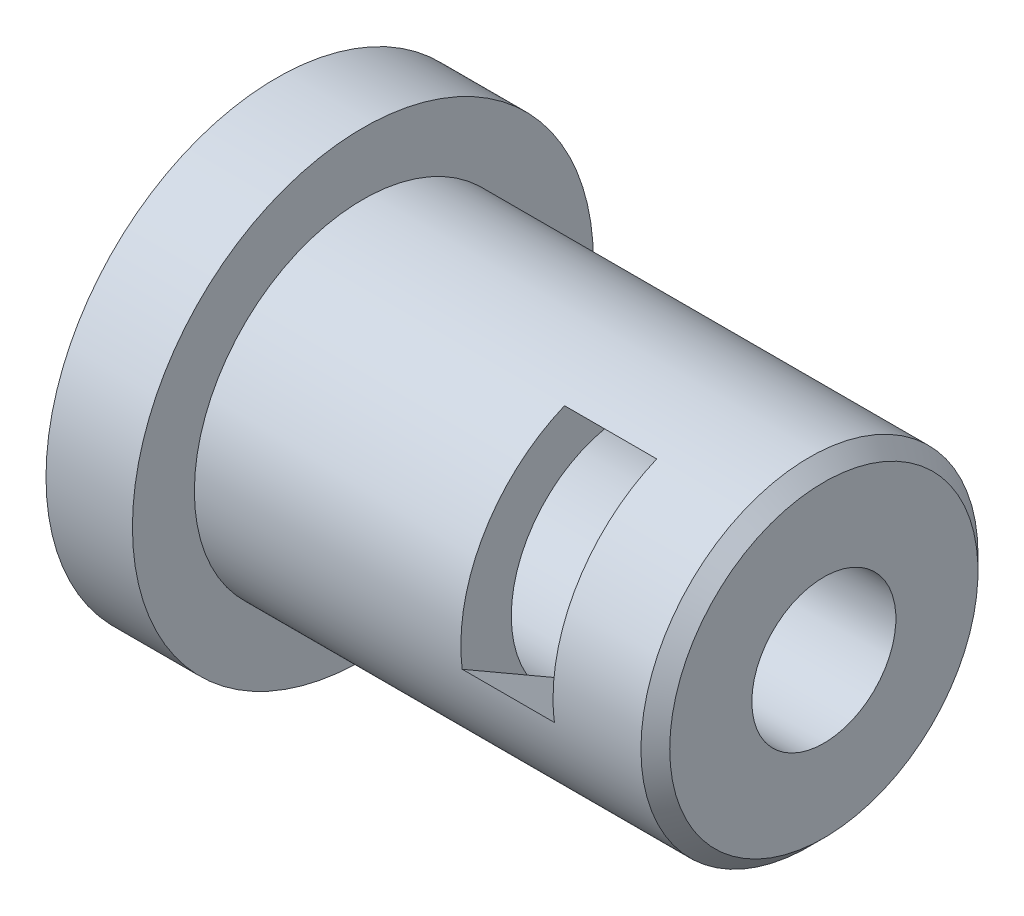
ISO-10303-21;
HEADER;
FILE_DESCRIPTION(('STEP AP214'),'2;1');
FILE_NAME('part.step','',(''),(''),'','','');
FILE_SCHEMA(('AUTOMOTIVE_DESIGN { 1 0 10303 214 1 1 1 1 }'));
ENDSEC;
DATA;
#1=APPLICATION_CONTEXT('core data for automotive mechanical design processes');
#2=APPLICATION_PROTOCOL_DEFINITION('international standard','automotive_design',2000,#1);
#3=PRODUCT_CONTEXT('',#1,'mechanical');
#4=PRODUCT('Part','Part','',(#3));
#5=PRODUCT_RELATED_PRODUCT_CATEGORY('part','',(#4));
#6=PRODUCT_DEFINITION_FORMATION('','',#4);
#7=PRODUCT_DEFINITION_CONTEXT('part definition',#1,'design');
#8=PRODUCT_DEFINITION('design','',#6,#7);
#9=PRODUCT_DEFINITION_SHAPE('','',#8);
#10=(LENGTH_UNIT() NAMED_UNIT(*) SI_UNIT(.MILLI.,.METRE.));
#11=(NAMED_UNIT(*) PLANE_ANGLE_UNIT() SI_UNIT($,.RADIAN.));
#12=(NAMED_UNIT(*) SI_UNIT($,.STERADIAN.) SOLID_ANGLE_UNIT());
#13=UNCERTAINTY_MEASURE_WITH_UNIT(LENGTH_MEASURE(1.E-05),#10,'distance_accuracy_value','');
#14=(GEOMETRIC_REPRESENTATION_CONTEXT(3) GLOBAL_UNCERTAINTY_ASSIGNED_CONTEXT((#13)) GLOBAL_UNIT_ASSIGNED_CONTEXT((#10,
#11,#12)) REPRESENTATION_CONTEXT('',''));
#15=CARTESIAN_POINT('',(0.,0.,0.));
#16=DIRECTION('',(0.,0.,1.));
#17=DIRECTION('',(1.,0.,0.));
#18=AXIS2_PLACEMENT_3D('',#15,#16,#17);
#19=CARTESIAN_POINT('',(-9.41062293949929,0.,0.));
#20=DIRECTION('',(-1.,0.,0.));
#21=DIRECTION('',(0.,0.,1.));
#22=AXIS2_PLACEMENT_3D('',#19,#20,#21);
#23=CYLINDRICAL_SURFACE('',#22,2.5);
#24=CARTESIAN_POINT('',(19.,0.,0.));
#25=DIRECTION('',(-1.,0.,0.));
#26=DIRECTION('',(0.,0.,1.));
#27=AXIS2_PLACEMENT_3D('',#24,#25,#26);
#28=CIRCLE('',#27,2.5);
#29=CARTESIAN_POINT('',(19.,0.,2.5));
#30=VERTEX_POINT('',#29);
#31=EDGE_CURVE('E178',#30,#30,#28,.T.);
#32=ORIENTED_EDGE('',*,*,#31,.F.);
#33=EDGE_LOOP('',(#32));
#34=FACE_BOUND('',#33,.T.);
#35=CARTESIAN_POINT('',(15.45,0.,0.));
#36=DIRECTION('',(-1.,0.,0.));
#37=DIRECTION('',(0.,-1.,0.));
#38=AXIS2_PLACEMENT_3D('',#35,#36,#37);
#39=CIRCLE('',#38,2.5);
#40=CARTESIAN_POINT('',(15.45,-2.5,0.));
#41=VERTEX_POINT('',#40);
#42=EDGE_CURVE('E54',#41,#41,#39,.F.);
#43=ORIENTED_EDGE('',*,*,#42,.F.);
#44=EDGE_LOOP('',(#43));
#45=FACE_BOUND('',#44,.T.);
#46=ADVANCED_FACE('F49',(#34,#45),#23,.F.);
#47=CARTESIAN_POINT('',(-9.41062293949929,0.,0.));
#48=DIRECTION('',(-1.,0.,0.));
#49=DIRECTION('',(0.,0.,1.));
#50=AXIS2_PLACEMENT_3D('',#47,#48,#49);
#51=CYLINDRICAL_SURFACE('',#50,4.1);
#52=CARTESIAN_POINT('',(0.500000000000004,0.,0.));
#53=DIRECTION('',(1.,0.,0.));
#54=DIRECTION('',(0.,0.,-1.));
#55=AXIS2_PLACEMENT_3D('',#52,#53,#54);
#56=CIRCLE('',#55,4.1);
#57=CARTESIAN_POINT('',(0.500000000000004,0.,-4.1));
#58=VERTEX_POINT('',#57);
#59=EDGE_CURVE('E60',#58,#58,#56,.F.);
#60=ORIENTED_EDGE('',*,*,#59,.T.);
#61=EDGE_LOOP('',(#60));
#62=FACE_BOUND('',#61,.T.);
#63=CARTESIAN_POINT('',(12.25,0.,0.));
#64=DIRECTION('',(-1.,0.,0.));
#65=DIRECTION('',(0.,0.,1.));
#66=AXIS2_PLACEMENT_3D('',#63,#64,#65);
#67=CIRCLE('',#66,4.1);
#68=CARTESIAN_POINT('',(12.25,4.1,0.0014083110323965));
#69=VERTEX_POINT('',#68);
#70=CARTESIAN_POINT('',(12.25,-2.04878060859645,3.55140789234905));
#71=VERTEX_POINT('',#70);
#72=EDGE_CURVE('E174',#69,#71,#67,.T.);
#73=ORIENTED_EDGE('',*,*,#72,.F.);
#74=CARTESIAN_POINT('',(12.25,0.,0.));
#75=DIRECTION('',(-1.,0.,0.));
#76=DIRECTION('',(0.,0.,1.));
#77=AXIS2_PLACEMENT_3D('',#74,#75,#76);
#78=CIRCLE('',#77,4.1);
#79=EDGE_CURVE('E140',#69,#71,#78,.F.);
#80=ORIENTED_EDGE('',*,*,#79,.T.);
#81=EDGE_LOOP('',(#73,#80));
#82=FACE_BOUND('',#81,.T.);
#83=ADVANCED_FACE('F206',(#62,#82),#51,.F.);
#84=CARTESIAN_POINT('',(0.,4.1,0.));
#85=DIRECTION('',(1.,0.,0.));
#86=DIRECTION('',(0.,0.,-1.));
#87=AXIS2_PLACEMENT_3D('',#84,#85,#86);
#88=PLANE('',#87);
#89=CARTESIAN_POINT('',(0.,0.,0.));
#90=DIRECTION('',(1.,0.,0.));
#91=DIRECTION('',(0.,0.,-1.));
#92=AXIS2_PLACEMENT_3D('',#89,#90,#91);
#93=CIRCLE('',#92,4.60000000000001);
#94=CARTESIAN_POINT('',(0.,0.,-4.60000000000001));
#95=VERTEX_POINT('',#94);
#96=EDGE_CURVE('E11',#95,#95,#93,.T.);
#97=ORIENTED_EDGE('',*,*,#96,.T.);
#98=EDGE_LOOP('',(#97));
#99=FACE_BOUND('',#98,.T.);
#100=CARTESIAN_POINT('',(0.,0.,0.));
#101=DIRECTION('',(-1.,0.,0.));
#102=DIRECTION('',(0.,0.,1.));
#103=AXIS2_PLACEMENT_3D('',#100,#101,#102);
#104=CIRCLE('',#103,8.);
#105=CARTESIAN_POINT('',(0.,0.,8.));
#106=VERTEX_POINT('',#105);
#107=EDGE_CURVE('E190',#106,#106,#104,.T.);
#108=ORIENTED_EDGE('',*,*,#107,.T.);
#109=EDGE_LOOP('',(#108));
#110=FACE_BOUND('',#109,.T.);
#111=ADVANCED_FACE('F229',(#99,#110),#88,.F.);
#112=CARTESIAN_POINT('',(-9.41062293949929,0.,0.));
#113=DIRECTION('',(-1.,0.,0.));
#114=DIRECTION('',(0.,0.,1.));
#115=AXIS2_PLACEMENT_3D('',#112,#113,#114);
#116=CYLINDRICAL_SURFACE('',#115,8.);
#117=ORIENTED_EDGE('',*,*,#107,.F.);
#118=EDGE_LOOP('',(#117));
#119=FACE_BOUND('',#118,.T.);
#120=CARTESIAN_POINT('',(3.,0.,0.));
#121=DIRECTION('',(-1.,0.,0.));
#122=DIRECTION('',(0.,0.,1.));
#123=AXIS2_PLACEMENT_3D('',#120,#121,#122);
#124=CIRCLE('',#123,8.);
#125=CARTESIAN_POINT('',(3.,0.,8.));
#126=VERTEX_POINT('',#125);
#127=EDGE_CURVE('E186',#126,#126,#124,.T.);
#128=ORIENTED_EDGE('',*,*,#127,.T.);
#129=EDGE_LOOP('',(#128));
#130=FACE_BOUND('',#129,.T.);
#131=ADVANCED_FACE('F245',(#119,#130),#116,.T.);
#132=CARTESIAN_POINT('',(3.,8.,0.));
#133=DIRECTION('',(-1.,0.,0.));
#134=DIRECTION('',(0.,0.,1.));
#135=AXIS2_PLACEMENT_3D('',#132,#133,#134);
#136=PLANE('',#135);
#137=ORIENTED_EDGE('',*,*,#127,.F.);
#138=EDGE_LOOP('',(#137));
#139=FACE_BOUND('',#138,.T.);
#140=CARTESIAN_POINT('',(3.,0.,0.));
#141=DIRECTION('',(-1.,0.,0.));
#142=DIRECTION('',(0.,0.,1.));
#143=AXIS2_PLACEMENT_3D('',#140,#141,#142);
#144=CIRCLE('',#143,5.85);
#145=CARTESIAN_POINT('',(3.,0.,5.85));
#146=VERTEX_POINT('',#145);
#147=EDGE_CURVE('E182',#146,#146,#144,.T.);
#148=ORIENTED_EDGE('',*,*,#147,.T.);
#149=EDGE_LOOP('',(#148));
#150=FACE_BOUND('',#149,.T.);
#151=ADVANCED_FACE('F242',(#139,#150),#136,.F.);
#152=CARTESIAN_POINT('',(-9.41062293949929,0.,0.));
#153=DIRECTION('',(-1.,0.,0.));
#154=DIRECTION('',(0.,0.,1.));
#155=AXIS2_PLACEMENT_3D('',#152,#153,#154);
#156=CYLINDRICAL_SURFACE('',#155,5.85);
#157=DIRECTION('',(-1.,0.,0.));
#158=VECTOR('',#157,1.);
#159=CARTESIAN_POINT('',(-9.41062293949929,-0.74952459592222,5.80178531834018));
#160=LINE('',#159,#158);
#161=CARTESIAN_POINT('',(15.45,-0.749524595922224,5.80178531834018));
#162=VERTEX_POINT('',#161);
#163=CARTESIAN_POINT('',(12.25,-0.749524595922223,5.80178531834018));
#164=VERTEX_POINT('',#163);
#165=EDGE_CURVE('E119',#162,#164,#160,.T.);
#166=ORIENTED_EDGE('',*,*,#165,.T.);
#167=CARTESIAN_POINT('',(12.25,0.,0.));
#168=DIRECTION('',(-1.,0.,0.));
#169=DIRECTION('',(0.,0.,1.));
#170=AXIS2_PLACEMENT_3D('',#167,#168,#169);
#171=CIRCLE('',#170,5.85);
#172=CARTESIAN_POINT('',(12.25,5.39925577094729,2.25178531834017));
#173=VERTEX_POINT('',#172);
#174=EDGE_CURVE('E126',#164,#173,#171,.T.);
#175=ORIENTED_EDGE('',*,*,#174,.T.);
#176=DIRECTION('',(-1.,0.,0.));
#177=VECTOR('',#176,1.);
#178=CARTESIAN_POINT('',(-9.41062293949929,5.39925577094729,2.25178531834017));
#179=LINE('',#178,#177);
#180=CARTESIAN_POINT('',(15.45,5.39925577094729,2.25178531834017));
#181=VERTEX_POINT('',#180);
#182=EDGE_CURVE('E130',#173,#181,#179,.F.);
#183=ORIENTED_EDGE('',*,*,#182,.T.);
#184=CARTESIAN_POINT('',(15.45,0.,0.));
#185=DIRECTION('',(1.,0.,0.));
#186=DIRECTION('',(0.,1.,0.));
#187=AXIS2_PLACEMENT_3D('',#184,#185,#186);
#188=CIRCLE('',#187,5.85);
#189=EDGE_CURVE('E111',#181,#162,#188,.T.);
#190=ORIENTED_EDGE('',*,*,#189,.T.);
#191=EDGE_LOOP('',(#166,#175,#183,#190));
#192=FACE_BOUND('',#191,.T.);
#193=CARTESIAN_POINT('',(18.5,0.,0.));
#194=DIRECTION('',(-1.,0.,0.));
#195=DIRECTION('',(0.,0.,1.));
#196=AXIS2_PLACEMENT_3D('',#193,#194,#195);
#197=CIRCLE('',#196,5.85);
#198=CARTESIAN_POINT('',(18.5,0.,5.85));
#199=VERTEX_POINT('',#198);
#200=EDGE_CURVE('E194',#199,#199,#197,.T.);
#201=ORIENTED_EDGE('',*,*,#200,.T.);
#202=EDGE_LOOP('',(#201));
#203=FACE_BOUND('',#202,.T.);
#204=ORIENTED_EDGE('',*,*,#147,.F.);
#205=EDGE_LOOP('',(#204));
#206=FACE_BOUND('',#205,.T.);
#207=ADVANCED_FACE('F128',(#192,#203,#206),#156,.T.);
#208=CARTESIAN_POINT('',(19.,5.85,0.));
#209=DIRECTION('',(-1.,0.,0.));
#210=DIRECTION('',(0.,0.,1.));
#211=AXIS2_PLACEMENT_3D('',#208,#209,#210);
#212=PLANE('',#211);
#213=CARTESIAN_POINT('',(19.,0.,0.));
#214=DIRECTION('',(-1.,0.,0.));
#215=DIRECTION('',(0.,0.,1.));
#216=AXIS2_PLACEMENT_3D('',#213,#214,#215);
#217=CIRCLE('',#216,5.34999999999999);
#218=CARTESIAN_POINT('',(19.,0.,5.34999999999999));
#219=VERTEX_POINT('',#218);
#220=EDGE_CURVE('E198',#219,#219,#217,.F.);
#221=ORIENTED_EDGE('',*,*,#220,.T.);
#222=EDGE_LOOP('',(#221));
#223=FACE_BOUND('',#222,.T.);
#224=ORIENTED_EDGE('',*,*,#31,.T.);
#225=EDGE_LOOP('',(#224));
#226=FACE_BOUND('',#225,.T.);
#227=ADVANCED_FACE('F236',(#223,#226),#212,.F.);
#228=CARTESIAN_POINT('',(12.25,2.5,0.));
#229=DIRECTION('',(1.,0.,0.));
#230=DIRECTION('',(0.,0.,-1.));
#231=AXIS2_PLACEMENT_3D('',#228,#229,#230);
#232=PLANE('',#231);
#233=ORIENTED_EDGE('',*,*,#72,.T.);
#234=DIRECTION('',(0.,0.5,0.866025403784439));
#235=VECTOR('',#234,1.);
#236=CARTESIAN_POINT('',(12.25,-4.09918691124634,0.));
#237=LINE('',#236,#235);
#238=CARTESIAN_POINT('',(12.25,-4.09918691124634,0.));
#239=VERTEX_POINT('',#238);
#240=EDGE_CURVE('E145',#239,#71,#237,.T.);
#241=ORIENTED_EDGE('',*,*,#240,.F.);
#242=DIRECTION('',(0.,-0.5,0.866025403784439));
#243=VECTOR('',#242,1.);
#244=CARTESIAN_POINT('',(12.25,-2.04959345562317,-3.55));
#245=LINE('',#244,#243);
#246=CARTESIAN_POINT('',(12.25,-2.04959345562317,-3.55));
#247=VERTEX_POINT('',#246);
#248=EDGE_CURVE('E115',#247,#239,#245,.T.);
#249=ORIENTED_EDGE('',*,*,#248,.F.);
#250=DIRECTION('',(0.,-1.,0.));
#251=VECTOR('',#250,1.);
#252=CARTESIAN_POINT('',(12.25,2.04959345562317,-3.55));
#253=LINE('',#252,#251);
#254=CARTESIAN_POINT('',(12.25,2.04959345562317,-3.55));
#255=VERTEX_POINT('',#254);
#256=EDGE_CURVE('E160',#255,#247,#253,.T.);
#257=ORIENTED_EDGE('',*,*,#256,.F.);
#258=DIRECTION('',(0.,-0.5,-0.866025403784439));
#259=VECTOR('',#258,1.);
#260=CARTESIAN_POINT('',(12.25,4.09918691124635,0.));
#261=LINE('',#260,#259);
#262=EDGE_CURVE('E157',#69,#255,#261,.T.);
#263=ORIENTED_EDGE('',*,*,#262,.F.);
#264=EDGE_LOOP('',(#233,#241,#249,#257,#263));
#265=FACE_BOUND('',#264,.T.);
#266=ADVANCED_FACE('F219',(#265),#232,.F.);
#267=CARTESIAN_POINT('',(18.5,0.,0.));
#268=DIRECTION('',(-1.,0.,0.));
#269=DIRECTION('',(0.,0.,1.));
#270=AXIS2_PLACEMENT_3D('',#267,#268,#269);
#271=CONICAL_SURFACE('',#270,5.85,0.785398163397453);
#272=ORIENTED_EDGE('',*,*,#220,.F.);
#273=EDGE_LOOP('',(#272));
#274=FACE_BOUND('',#273,.T.);
#275=ORIENTED_EDGE('',*,*,#200,.F.);
#276=EDGE_LOOP('',(#275));
#277=FACE_BOUND('',#276,.T.);
#278=ADVANCED_FACE('F210',(#274,#277),#271,.T.);
#279=CARTESIAN_POINT('',(0.500000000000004,0.,0.));
#280=DIRECTION('',(-1.,0.,0.));
#281=DIRECTION('',(0.,0.,1.));
#282=AXIS2_PLACEMENT_3D('',#279,#280,#281);
#283=CONICAL_SURFACE('',#282,4.1,0.785398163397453);
#284=ORIENTED_EDGE('',*,*,#96,.F.);
#285=EDGE_LOOP('',(#284));
#286=FACE_BOUND('',#285,.T.);
#287=ORIENTED_EDGE('',*,*,#59,.F.);
#288=EDGE_LOOP('',(#287));
#289=FACE_BOUND('',#288,.T.);
#290=ADVANCED_FACE('F52',(#286,#289),#283,.F.);
#291=CARTESIAN_POINT('',(15.45,0.,0.));
#292=DIRECTION('',(-1.,0.,0.));
#293=DIRECTION('',(0.,-1.,0.));
#294=AXIS2_PLACEMENT_3D('',#291,#292,#293);
#295=PLANE('',#294);
#296=ORIENTED_EDGE('',*,*,#42,.T.);
#297=EDGE_LOOP('',(#296));
#298=FACE_BOUND('',#297,.T.);
#299=ORIENTED_EDGE('',*,*,#189,.F.);
#300=DIRECTION('',(0.,-0.5,-0.866025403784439));
#301=VECTOR('',#300,1.);
#302=CARTESIAN_POINT('',(15.45,4.09918691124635,0.));
#303=LINE('',#302,#301);
#304=CARTESIAN_POINT('',(15.45,2.04959345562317,-3.55));
#305=VERTEX_POINT('',#304);
#306=EDGE_CURVE('E67',#181,#305,#303,.T.);
#307=ORIENTED_EDGE('',*,*,#306,.T.);
#308=DIRECTION('',(0.,-1.,0.));
#309=VECTOR('',#308,1.);
#310=CARTESIAN_POINT('',(15.45,2.04959345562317,-3.55));
#311=LINE('',#310,#309);
#312=CARTESIAN_POINT('',(15.45,-2.04959345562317,-3.55));
#313=VERTEX_POINT('',#312);
#314=EDGE_CURVE('E149',#305,#313,#311,.T.);
#315=ORIENTED_EDGE('',*,*,#314,.T.);
#316=DIRECTION('',(0.,-0.5,0.866025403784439));
#317=VECTOR('',#316,1.);
#318=CARTESIAN_POINT('',(15.45,-2.04959345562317,-3.55));
#319=LINE('',#318,#317);
#320=CARTESIAN_POINT('',(15.45,-4.09918691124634,0.));
#321=VERTEX_POINT('',#320);
#322=EDGE_CURVE('E113',#313,#321,#319,.T.);
#323=ORIENTED_EDGE('',*,*,#322,.T.);
#324=DIRECTION('',(0.,0.5,0.866025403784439));
#325=VECTOR('',#324,1.);
#326=CARTESIAN_POINT('',(15.45,-4.09918691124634,0.));
#327=LINE('',#326,#325);
#328=EDGE_CURVE('E107',#321,#162,#327,.T.);
#329=ORIENTED_EDGE('',*,*,#328,.T.);
#330=EDGE_LOOP('',(#299,#307,#315,#323,#329));
#331=FACE_BOUND('',#330,.T.);
#332=ADVANCED_FACE('F109',(#298,#331),#295,.T.);
#333=CARTESIAN_POINT('',(15.45,-4.09918691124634,0.));
#334=DIRECTION('',(0.,-0.866025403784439,0.5));
#335=DIRECTION('',(0.,-0.5,-0.866025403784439));
#336=AXIS2_PLACEMENT_3D('',#333,#334,#335);
#337=PLANE('',#336);
#338=ORIENTED_EDGE('',*,*,#165,.F.);
#339=ORIENTED_EDGE('',*,*,#328,.F.);
#340=DIRECTION('',(-1.,0.,0.));
#341=VECTOR('',#340,1.);
#342=CARTESIAN_POINT('',(15.45,-4.09918691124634,0.));
#343=LINE('',#342,#341);
#344=EDGE_CURVE('E76',#321,#239,#343,.T.);
#345=ORIENTED_EDGE('',*,*,#344,.T.);
#346=ORIENTED_EDGE('',*,*,#240,.T.);
#347=DIRECTION('',(0.,-0.5,-0.866025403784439));
#348=VECTOR('',#347,1.);
#349=CARTESIAN_POINT('',(12.25,2.38971143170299,11.2391016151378));
#350=LINE('',#349,#348);
#351=EDGE_CURVE('E122',#164,#71,#350,.T.);
#352=ORIENTED_EDGE('',*,*,#351,.F.);
#353=EDGE_LOOP('',(#338,#339,#345,#346,#352));
#354=FACE_BOUND('',#353,.T.);
#355=ADVANCED_FACE('F120',(#354),#337,.F.);
#356=CARTESIAN_POINT('',(15.45,-2.04959345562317,-3.55));
#357=DIRECTION('',(0.,-0.866025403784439,-0.5));
#358=DIRECTION('',(0.,0.5,-0.866025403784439));
#359=AXIS2_PLACEMENT_3D('',#356,#357,#358);
#360=PLANE('',#359);
#361=ORIENTED_EDGE('',*,*,#248,.T.);
#362=ORIENTED_EDGE('',*,*,#344,.F.);
#363=ORIENTED_EDGE('',*,*,#322,.F.);
#364=DIRECTION('',(-1.,0.,0.));
#365=VECTOR('',#364,1.);
#366=CARTESIAN_POINT('',(15.45,-2.04959345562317,-3.55));
#367=LINE('',#366,#365);
#368=EDGE_CURVE('E168',#313,#247,#367,.T.);
#369=ORIENTED_EDGE('',*,*,#368,.T.);
#370=EDGE_LOOP('',(#361,#362,#363,#369));
#371=FACE_BOUND('',#370,.T.);
#372=ADVANCED_FACE('F314',(#371),#360,.F.);
#373=CARTESIAN_POINT('',(15.45,2.04959345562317,-3.55));
#374=DIRECTION('',(0.,0.,-1.));
#375=DIRECTION('',(0.,1.,0.));
#376=AXIS2_PLACEMENT_3D('',#373,#374,#375);
#377=PLANE('',#376);
#378=ORIENTED_EDGE('',*,*,#256,.T.);
#379=ORIENTED_EDGE('',*,*,#368,.F.);
#380=ORIENTED_EDGE('',*,*,#314,.F.);
#381=DIRECTION('',(-1.,0.,0.));
#382=VECTOR('',#381,1.);
#383=CARTESIAN_POINT('',(15.45,2.04959345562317,-3.55));
#384=LINE('',#383,#382);
#385=EDGE_CURVE('E154',#305,#255,#384,.T.);
#386=ORIENTED_EDGE('',*,*,#385,.T.);
#387=EDGE_LOOP('',(#378,#379,#380,#386));
#388=FACE_BOUND('',#387,.T.);
#389=ADVANCED_FACE('F323',(#388),#377,.F.);
#390=CARTESIAN_POINT('',(15.45,4.09918691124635,0.));
#391=DIRECTION('',(0.,0.866025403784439,-0.5));
#392=DIRECTION('',(0.,0.5,0.866025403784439));
#393=AXIS2_PLACEMENT_3D('',#390,#391,#392);
#394=PLANE('',#393);
#395=ORIENTED_EDGE('',*,*,#262,.T.);
#396=ORIENTED_EDGE('',*,*,#385,.F.);
#397=ORIENTED_EDGE('',*,*,#306,.F.);
#398=ORIENTED_EDGE('',*,*,#182,.F.);
#399=DIRECTION('',(0.,-0.5,-0.866025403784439));
#400=VECTOR('',#399,1.);
#401=CARTESIAN_POINT('',(12.25,8.53849179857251,7.68910161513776));
#402=LINE('',#401,#400);
#403=EDGE_CURVE('E134',#173,#69,#402,.T.);
#404=ORIENTED_EDGE('',*,*,#403,.T.);
#405=EDGE_LOOP('',(#395,#396,#397,#398,#404));
#406=FACE_BOUND('',#405,.T.);
#407=ADVANCED_FACE('F330',(#406),#394,.F.);
#408=CARTESIAN_POINT('',(12.25,8.53849179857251,7.68910161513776));
#409=DIRECTION('',(-1.,0.,0.));
#410=DIRECTION('',(0.,0.,1.));
#411=AXIS2_PLACEMENT_3D('',#408,#409,#410);
#412=PLANE('',#411);
#413=ORIENTED_EDGE('',*,*,#403,.F.);
#414=ORIENTED_EDGE('',*,*,#174,.F.);
#415=ORIENTED_EDGE('',*,*,#351,.T.);
#416=ORIENTED_EDGE('',*,*,#79,.F.);
#417=EDGE_LOOP('',(#413,#414,#415,#416));
#418=FACE_BOUND('',#417,.T.);
#419=ADVANCED_FACE('F339',(#418),#412,.F.);
#420=CLOSED_SHELL('',(#46,#83,#111,#131,#151,#207,#227,#266,#278,#290,#332,#355,#372,#389,#407,#419));
#421=MANIFOLD_SOLID_BREP('B2',#420);
#422=ADVANCED_BREP_SHAPE_REPRESENTATION('',(#18,#421),#14);
#423=SHAPE_DEFINITION_REPRESENTATION(#9,#422);
ENDSEC;
END-ISO-10303-21;
